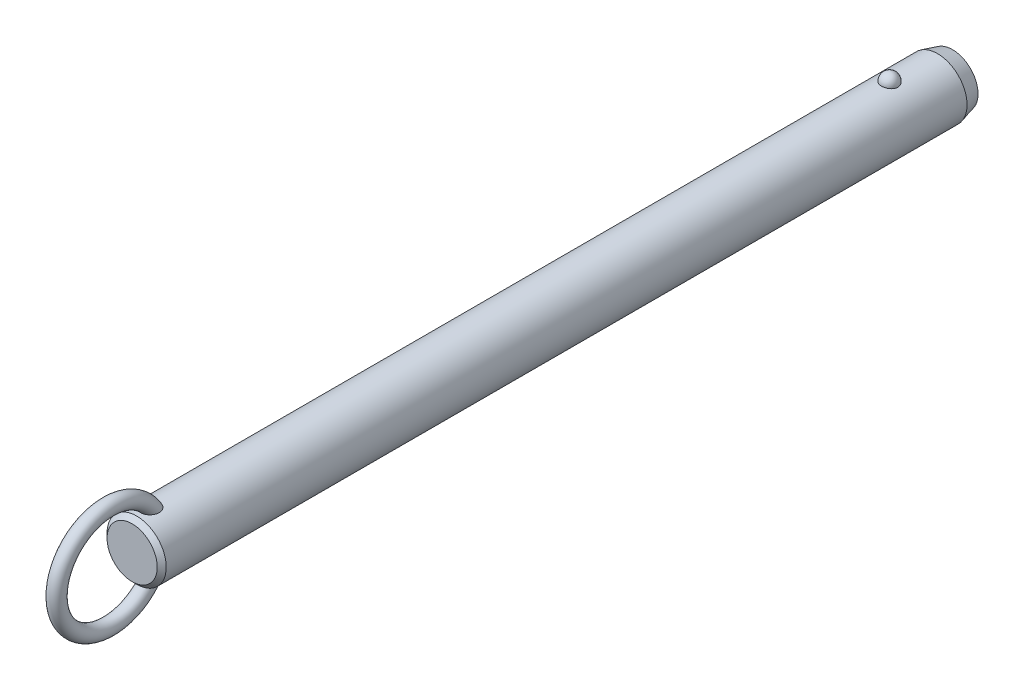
ISO-10303-21;
HEADER;
FILE_DESCRIPTION(('STEP AP214'),'2;1');
FILE_NAME('part.step','',(''),(''),'','','');
FILE_SCHEMA(('AUTOMOTIVE_DESIGN { 1 0 10303 214 1 1 1 1 }'));
ENDSEC;
DATA;
#1=APPLICATION_CONTEXT('core data for automotive mechanical design processes');
#2=APPLICATION_PROTOCOL_DEFINITION('international standard','automotive_design',2000,#1);
#3=PRODUCT_CONTEXT('',#1,'mechanical');
#4=PRODUCT('Part','Part','',(#3));
#5=PRODUCT_RELATED_PRODUCT_CATEGORY('part','',(#4));
#6=PRODUCT_DEFINITION_FORMATION('','',#4);
#7=PRODUCT_DEFINITION_CONTEXT('part definition',#1,'design');
#8=PRODUCT_DEFINITION('design','',#6,#7);
#9=PRODUCT_DEFINITION_SHAPE('','',#8);
#10=(LENGTH_UNIT() NAMED_UNIT(*) SI_UNIT(.MILLI.,.METRE.));
#11=(NAMED_UNIT(*) PLANE_ANGLE_UNIT() SI_UNIT($,.RADIAN.));
#12=(NAMED_UNIT(*) SI_UNIT($,.STERADIAN.) SOLID_ANGLE_UNIT());
#13=UNCERTAINTY_MEASURE_WITH_UNIT(LENGTH_MEASURE(1.E-05),#10,'distance_accuracy_value','');
#14=(GEOMETRIC_REPRESENTATION_CONTEXT(3) GLOBAL_UNCERTAINTY_ASSIGNED_CONTEXT((#13)) GLOBAL_UNIT_ASSIGNED_CONTEXT((#10,
#11,#12)) REPRESENTATION_CONTEXT('',''));
#15=CARTESIAN_POINT('',(0.,0.,0.));
#16=DIRECTION('',(0.,0.,1.));
#17=DIRECTION('',(1.,0.,0.));
#18=AXIS2_PLACEMENT_3D('',#15,#16,#17);
#19=CARTESIAN_POINT('',(0.,0.,190.5));
#20=DIRECTION('',(0.,0.,-1.));
#21=DIRECTION('',(-1.,0.,0.));
#22=AXIS2_PLACEMENT_3D('',#19,#20,#21);
#23=CYLINDRICAL_SURFACE('',#22,7.9);
#24=CARTESIAN_POINT('',(2.1785689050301,7.59367088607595,-2.20000000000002));
#25=CARTESIAN_POINT('',(2.17856679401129,7.59367269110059,-2.07701843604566));
#26=CARTESIAN_POINT('',(2.16853481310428,7.59657145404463,-1.95401006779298));
#27=CARTESIAN_POINT('',(2.12864689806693,7.607843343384,-1.71147811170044));
#28=CARTESIAN_POINT('',(2.09878338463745,7.61621856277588,-1.5919558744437));
#29=CARTESIAN_POINT('',(2.0199931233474,7.63749180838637,-1.35985638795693));
#30=CARTESIAN_POINT('',(1.97107475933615,7.6503878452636,-1.24727610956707));
#31=CARTESIAN_POINT('',(1.85539377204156,7.67926115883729,-1.03213234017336));
#32=CARTESIAN_POINT('',(1.78863158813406,7.69523835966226,-0.929568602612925));
#33=CARTESIAN_POINT('',(1.63856494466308,7.7285848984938,-0.73678633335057));
#34=CARTESIAN_POINT('',(1.55518140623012,7.7459606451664,-0.646630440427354));
#35=CARTESIAN_POINT('',(1.37422937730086,7.78009978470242,-0.481747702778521));
#36=CARTESIAN_POINT('',(1.27666086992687,7.79686317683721,-0.407020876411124));
#37=CARTESIAN_POINT('',(1.07024728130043,7.82786153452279,-0.275278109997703));
#38=CARTESIAN_POINT('',(0.961434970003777,7.84210353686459,-0.218212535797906));
#39=CARTESIAN_POINT('',(0.735351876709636,7.86652194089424,-0.123146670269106));
#40=CARTESIAN_POINT('',(0.618082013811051,7.87669878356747,-0.0851443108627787));
#41=CARTESIAN_POINT('',(0.380637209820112,7.89170521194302,-0.0298158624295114));
#42=CARTESIAN_POINT('',(0.260550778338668,7.89662650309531,-0.0121347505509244));
#43=CARTESIAN_POINT('',(0.0190117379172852,7.90090003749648,0.00324379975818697));
#44=CARTESIAN_POINT('',(-0.102440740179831,7.90025280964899,0.000943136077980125));
#45=CARTESIAN_POINT('',(-0.341452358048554,7.89351056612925,-0.0233955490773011));
#46=CARTESIAN_POINT('',(-0.459042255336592,7.88749257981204,-0.0451545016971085));
#47=CARTESIAN_POINT('',(-0.688796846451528,7.87075812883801,-0.107408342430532));
#48=CARTESIAN_POINT('',(-0.800961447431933,7.86004158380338,-0.14790355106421));
#49=CARTESIAN_POINT('',(-1.01743634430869,7.83497131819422,-0.246799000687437));
#50=CARTESIAN_POINT('',(-1.12169791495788,7.82059709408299,-0.305300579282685));
#51=CARTESIAN_POINT('',(-1.31891765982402,7.78976470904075,-0.43854939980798));
#52=CARTESIAN_POINT('',(-1.41187469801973,7.77330633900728,-0.513298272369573));
#53=CARTESIAN_POINT('',(-1.58577142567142,7.73972434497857,-0.678622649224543));
#54=CARTESIAN_POINT('',(-1.66645140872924,7.72259402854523,-0.769470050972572));
#55=CARTESIAN_POINT('',(-1.81161503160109,7.68983776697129,-0.963538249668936));
#56=CARTESIAN_POINT('',(-1.87609753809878,7.6742119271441,-1.0667599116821));
#57=CARTESIAN_POINT('',(-1.98790138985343,7.6460202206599,-1.28401170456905));
#58=CARTESIAN_POINT('',(-2.03501994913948,7.63349104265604,-1.39815107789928));
#59=CARTESIAN_POINT('',(-2.10986724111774,7.6131449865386,-1.6330178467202));
#60=CARTESIAN_POINT('',(-2.1375965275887,7.60532797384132,-1.75374505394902));
#61=CARTESIAN_POINT('',(-2.17289256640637,7.5953195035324,-1.99782562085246));
#62=CARTESIAN_POINT('',(-2.18054294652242,7.59310471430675,-2.12116592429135));
#63=CARTESIAN_POINT('',(-2.17572919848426,7.59448538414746,-2.36741799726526));
#64=CARTESIAN_POINT('',(-2.1632656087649,7.59808068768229,-2.49032977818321));
#65=CARTESIAN_POINT('',(-2.11865035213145,7.61064035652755,-2.73161015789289));
#66=CARTESIAN_POINT('',(-2.08659579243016,7.61957823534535,-2.84999812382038));
#67=CARTESIAN_POINT('',(-2.00367799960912,7.64179982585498,-3.07955956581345));
#68=CARTESIAN_POINT('',(-1.9528140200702,7.65508371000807,-3.19073275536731));
#69=CARTESIAN_POINT('',(-1.83321113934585,7.68460381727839,-3.40337899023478));
#70=CARTESIAN_POINT('',(-1.76437735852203,7.70085556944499,-3.5047965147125));
#71=CARTESIAN_POINT('',(-1.61069526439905,7.73445734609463,-3.69446912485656));
#72=CARTESIAN_POINT('',(-1.52584634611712,7.75180741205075,-3.78272371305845));
#73=CARTESIAN_POINT('',(-1.34198059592,7.78574608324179,-3.94393987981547));
#74=CARTESIAN_POINT('',(-1.24291308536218,7.80233167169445,-4.01684434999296));
#75=CARTESIAN_POINT('',(-1.03352039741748,7.83281625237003,-4.14489386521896));
#76=CARTESIAN_POINT('',(-0.92319600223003,7.84671543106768,-4.20004014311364));
#77=CARTESIAN_POINT('',(-0.695822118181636,7.87011575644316,-4.29042017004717));
#78=CARTESIAN_POINT('',(-0.578872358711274,7.87966903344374,-4.32589112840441));
#79=CARTESIAN_POINT('',(-0.340410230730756,7.8935652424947,-4.37692226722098));
#80=CARTESIAN_POINT('',(-0.218898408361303,7.89790879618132,-4.39248482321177));
#81=CARTESIAN_POINT('',(0.0228107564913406,7.90087453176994,-4.40314405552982));
#82=CARTESIAN_POINT('',(0.142990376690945,7.89960185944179,-4.39861683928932));
#83=CARTESIAN_POINT('',(0.380829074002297,7.89171262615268,-4.37008293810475));
#84=CARTESIAN_POINT('',(0.498488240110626,7.8850962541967,-4.34607694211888));
#85=CARTESIAN_POINT('',(0.727535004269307,7.86726442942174,-4.27939317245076));
#86=CARTESIAN_POINT('',(0.838944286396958,7.85606616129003,-4.23678512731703));
#87=CARTESIAN_POINT('',(1.05295421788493,7.83025654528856,-4.13408348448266));
#88=CARTESIAN_POINT('',(1.15555431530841,7.81564498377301,-4.07398879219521));
#89=CARTESIAN_POINT('',(1.35076763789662,7.7843022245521,-3.93687432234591));
#90=CARTESIAN_POINT('',(1.4432046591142,7.76754209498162,-3.85961036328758));
#91=CARTESIAN_POINT('',(1.6139111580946,7.73387857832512,-3.69076949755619));
#92=CARTESIAN_POINT('',(1.6921781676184,7.71697516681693,-3.59919010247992));
#93=CARTESIAN_POINT('',(1.83380875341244,7.6845643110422,-3.40247278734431));
#94=CARTESIAN_POINT('',(1.89689280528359,7.66908588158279,-3.29712873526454));
#95=CARTESIAN_POINT('',(2.0047823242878,7.64159441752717,-3.07707931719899));
#96=CARTESIAN_POINT('',(2.0495945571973,7.62958010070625,-2.96237743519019));
#97=CARTESIAN_POINT('',(2.11580183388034,7.61146617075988,-2.74040519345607));
#98=CARTESIAN_POINT('',(2.13929812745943,7.60484503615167,-2.63379846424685));
#99=CARTESIAN_POINT('',(2.17068242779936,7.59594664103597,-2.4181348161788));
#100=CARTESIAN_POINT('',(2.17857077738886,7.59366928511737,-2.30907795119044));
#101=CARTESIAN_POINT('',(2.1785689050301,7.59367088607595,-2.20000000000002));
#102=B_SPLINE_CURVE_WITH_KNOTS('',3,(#24,#25,#26,#27,#28,#29,#30,#31,#32,#33,#34,#35,#36,#37,
#38,#39,#40,#41,#42,#43,#44,#45,#46,#47,#48,#49,#50,#51,#52,#53,#54,#55,#56,#57,#58,#59,#60,#61,
#62,#63,#64,#65,#66,#67,#68,#69,#70,#71,#72,#73,#74,#75,#76,#77,#78,#79,#80,#81,#82,#83,#84,#85,
#86,#87,#88,#89,#90,#91,#92,#93,#94,#95,#96,#97,#98,#99,#100,#101),.UNSPECIFIED.,.T.,.F.,(4,2,2,
2,2,2,2,2,2,2,2,2,2,2,2,2,2,2,2,2,2,2,2,2,2,2,2,2,2,2,2,2,2,2,2,2,2,2,4),(0.,0.368552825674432,
0.737246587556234,1.10577831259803,1.4743009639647,1.8446206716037,2.21494081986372,
2.5842105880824,2.95344028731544,3.31611630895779,3.67875788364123,4.03628044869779,
4.39380913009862,4.75338791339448,5.11300280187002,5.47939989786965,5.8458226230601,
6.21639834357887,6.58696347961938,6.95598276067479,7.32499216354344,7.69218715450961,
8.0593967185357,8.42858578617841,8.79778880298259,9.16834203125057,9.5388695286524,
9.90482699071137,10.2707407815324,10.6298333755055,10.9889132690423,11.3466585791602,
11.7044262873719,12.0676511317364,12.4309391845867,12.8004764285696,13.1698767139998,
13.4967701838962,13.8236564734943),.UNSPECIFIED.);
#103=CARTESIAN_POINT('',(2.1785689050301,7.59367088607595,-2.20000000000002));
#104=VERTEX_POINT('',#103);
#105=EDGE_CURVE('E41',#104,#104,#102,.T.);
#106=ORIENTED_EDGE('',*,*,#105,.T.);
#107=EDGE_LOOP('',(#106));
#108=FACE_BOUND('',#107,.T.);
#109=CARTESIAN_POINT('',(0.,0.,198.82));
#110=DIRECTION('',(0.,0.,1.));
#111=DIRECTION('',(1.,0.,0.));
#112=AXIS2_PLACEMENT_3D('',#109,#110,#111);
#113=CIRCLE('',#112,7.9);
#114=CARTESIAN_POINT('',(7.9,0.,198.82));
#115=VERTEX_POINT('',#114);
#116=EDGE_CURVE('E10',#115,#115,#113,.F.);
#117=ORIENTED_EDGE('',*,*,#116,.T.);
#118=EDGE_LOOP('',(#117));
#119=FACE_BOUND('',#118,.T.);
#120=CARTESIAN_POINT('',(-0.630969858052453,-7.87476203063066,192.712432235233));
#121=CARTESIAN_POINT('',(-0.734180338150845,-7.86648998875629,192.747285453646));
#122=CARTESIAN_POINT('',(-0.83447695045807,-7.85639291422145,192.790816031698));
#123=CARTESIAN_POINT('',(-1.0262035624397,-7.83366343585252,192.894094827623));
#124=CARTESIAN_POINT('',(-1.1176141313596,-7.82102565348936,192.953877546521));
#125=CARTESIAN_POINT('',(-1.28877277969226,-7.79464922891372,193.087839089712));
#126=CARTESIAN_POINT('',(-1.36854014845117,-7.78091246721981,193.161993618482));
#127=CARTESIAN_POINT('',(-1.51461521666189,-7.75380398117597,193.322494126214));
#128=CARTESIAN_POINT('',(-1.58092966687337,-7.74043207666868,193.408833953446));
#129=CARTESIAN_POINT('',(-1.70019064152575,-7.7151252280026,193.592978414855));
#130=CARTESIAN_POINT('',(-1.75284037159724,-7.70322473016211,193.690979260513));
#131=CARTESIAN_POINT('',(-1.84263464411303,-7.68224112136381,193.894102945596));
#132=CARTESIAN_POINT('',(-1.87977299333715,-7.6731591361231,193.999228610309));
#133=CARTESIAN_POINT('',(-1.94152728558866,-7.65777930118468,194.223284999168));
#134=CARTESIAN_POINT('',(-1.96475471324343,-7.65179654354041,194.342616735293));
#135=CARTESIAN_POINT('',(-1.99449499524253,-7.64409642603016,194.58342986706));
#136=CARTESIAN_POINT('',(-2.0010005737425,-7.64238092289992,194.704912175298));
#137=CARTESIAN_POINT('',(-1.99856014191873,-7.64302120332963,194.968340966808));
#138=CARTESIAN_POINT('',(-1.98680021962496,-7.64611845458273,195.11025654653));
#139=CARTESIAN_POINT('',(-1.94457772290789,-7.65696186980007,195.391118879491));
#140=CARTESIAN_POINT('',(-1.91409393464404,-7.66471330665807,195.530062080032));
#141=CARTESIAN_POINT('',(-1.82768670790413,-7.68582947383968,195.831939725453));
#142=CARTESIAN_POINT('',(-1.76772963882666,-7.70003779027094,195.993686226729));
#143=CARTESIAN_POINT('',(-1.65998501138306,-7.72371550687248,196.227695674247));
#144=CARTESIAN_POINT('',(-1.62107967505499,-7.73200670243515,196.304297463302));
#145=CARTESIAN_POINT('',(-1.53727726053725,-7.7491037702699,196.454079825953));
#146=CARTESIAN_POINT('',(-1.49238215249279,-7.75790947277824,196.527261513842));
#147=CARTESIAN_POINT('',(-1.37397050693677,-7.77993338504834,196.70288382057));
#148=CARTESIAN_POINT('',(-1.29690364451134,-7.79328473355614,196.802955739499));
#149=CARTESIAN_POINT('',(-1.12885487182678,-7.81939266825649,196.990714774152));
#150=CARTESIAN_POINT('',(-1.03789926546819,-7.83215032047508,197.078424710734));
#151=CARTESIAN_POINT('',(-0.869532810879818,-7.85231710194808,197.213414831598));
#152=CARTESIAN_POINT('',(-0.795716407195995,-7.86021093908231,197.265076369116));
#153=CARTESIAN_POINT('',(-0.640813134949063,-7.87434920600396,197.356381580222));
#154=CARTESIAN_POINT('',(-0.559737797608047,-7.88059619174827,197.39604389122));
#155=CARTESIAN_POINT('',(-0.406456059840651,-7.88984116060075,197.454300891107));
#156=CARTESIAN_POINT('',(-0.335227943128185,-7.89321892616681,197.475384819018));
#157=CARTESIAN_POINT('',(-0.190193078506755,-7.89804235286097,197.50541418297));
#158=CARTESIAN_POINT('',(-0.116388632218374,-7.89948969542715,197.514370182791));
#159=CARTESIAN_POINT('',(0.0318414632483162,-7.90028409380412,197.519291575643));
#160=CARTESIAN_POINT('',(0.106268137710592,-7.89962640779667,197.515227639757));
#161=CARTESIAN_POINT('',(0.253290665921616,-7.8962818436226,197.494461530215));
#162=CARTESIAN_POINT('',(0.325885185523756,-7.8935935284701,197.477750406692));
#163=CARTESIAN_POINT('',(0.481441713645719,-7.88577340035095,197.428738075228));
#164=CARTESIAN_POINT('',(0.563611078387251,-7.88026321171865,197.394005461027));
#165=CARTESIAN_POINT('',(0.721129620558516,-7.86741729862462,197.311796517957));
#166=CARTESIAN_POINT('',(0.79646633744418,-7.86007832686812,197.264297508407));
#167=CARTESIAN_POINT('',(0.971456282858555,-7.84073285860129,197.136513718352));
#168=CARTESIAN_POINT('',(1.06719686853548,-7.82809461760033,197.051004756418));
#169=CARTESIAN_POINT('',(1.24418921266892,-7.80192439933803,196.866232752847));
#170=CARTESIAN_POINT('',(1.32540832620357,-7.78839049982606,196.766939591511));
#171=CARTESIAN_POINT('',(1.45199971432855,-7.76559693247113,196.589576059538));
#172=CARTESIAN_POINT('',(1.50085649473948,-7.75626094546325,196.513954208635));
#173=CARTESIAN_POINT('',(1.59197749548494,-7.73807279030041,196.358742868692));
#174=CARTESIAN_POINT('',(1.63423919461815,-7.72922080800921,196.279151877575));
#175=CARTESIAN_POINT('',(1.71222612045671,-7.71231959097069,196.116664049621));
#176=CARTESIAN_POINT('',(1.74794516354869,-7.70427111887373,196.033764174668));
#177=CARTESIAN_POINT('',(1.81270113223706,-7.68929240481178,195.865296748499));
#178=CARTESIAN_POINT('',(1.84173789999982,-7.68236218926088,195.779729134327));
#179=CARTESIAN_POINT('',(1.89322698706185,-7.6698375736,195.60528702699));
#180=CARTESIAN_POINT('',(1.91558744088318,-7.66426199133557,195.516383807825));
#181=CARTESIAN_POINT('',(1.95281367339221,-7.65485915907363,195.336969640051));
#182=CARTESIAN_POINT('',(1.96767946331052,-7.65103190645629,195.246458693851));
#183=CARTESIAN_POINT('',(2.0002145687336,-7.64262981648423,194.973732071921));
#184=CARTESIAN_POINT('',(2.00600691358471,-7.6410871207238,194.789709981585));
#185=CARTESIAN_POINT('',(1.98445334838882,-7.64669564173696,194.476501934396));
#186=CARTESIAN_POINT('',(1.96607186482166,-7.65149688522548,194.346618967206));
#187=CARTESIAN_POINT('',(1.90884967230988,-7.66597624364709,194.091632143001));
#188=CARTESIAN_POINT('',(1.87002101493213,-7.67565148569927,193.966525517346));
#189=CARTESIAN_POINT('',(1.77063986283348,-7.69918471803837,193.72454013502));
#190=CARTESIAN_POINT('',(1.70993724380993,-7.71307150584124,193.607725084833));
#191=CARTESIAN_POINT('',(1.56733070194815,-7.74330306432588,193.388144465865));
#192=CARTESIAN_POINT('',(1.48543692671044,-7.75964665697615,193.285372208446));
#193=CARTESIAN_POINT('',(1.31346177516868,-7.79047523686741,193.109380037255));
#194=CARTESIAN_POINT('',(1.22547278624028,-7.80495298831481,193.034106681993));
#195=CARTESIAN_POINT('',(1.03724352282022,-7.83218597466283,192.900486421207));
#196=CARTESIAN_POINT('',(0.93700840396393,-7.84494192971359,192.842132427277));
#197=CARTESIAN_POINT('',(0.73359933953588,-7.86649045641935,192.747027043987));
#198=CARTESIAN_POINT('',(0.630941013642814,-7.87547134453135,192.709210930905));
#199=CARTESIAN_POINT('',(0.420465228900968,-7.88950708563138,192.651116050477));
#200=CARTESIAN_POINT('',(0.312645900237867,-7.89456050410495,192.63084369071));
#201=CARTESIAN_POINT('',(0.0960869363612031,-7.9001518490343,192.608455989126));
#202=CARTESIAN_POINT('',(-0.0126341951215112,-7.90073226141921,192.606169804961));
#203=CARTESIAN_POINT('',(-0.228766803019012,-7.89742350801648,192.619367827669));
#204=CARTESIAN_POINT('',(-0.336180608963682,-7.89354403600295,192.634813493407));
#205=CARTESIAN_POINT('',(-0.473410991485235,-7.88586871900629,192.666217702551));
#206=CARTESIAN_POINT('',(-0.50525779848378,-7.88388984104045,192.674354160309));
#207=CARTESIAN_POINT('',(-0.56848128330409,-7.87958326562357,192.692208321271));
#208=CARTESIAN_POINT('',(-0.59985795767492,-7.87725556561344,192.701926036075));
#209=CARTESIAN_POINT('',(-0.630969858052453,-7.87476203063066,192.712432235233));
#210=B_SPLINE_CURVE_WITH_KNOTS('',3,(#120,#121,#122,#123,#124,#125,#126,#127,#128,#129,#130,
#131,#132,#133,#134,#135,#136,#137,#138,#139,#140,#141,#142,#143,#144,#145,#146,#147,#148,#149,
#150,#151,#152,#153,#154,#155,#156,#157,#158,#159,#160,#161,#162,#163,#164,#165,#166,#167,#168,
#169,#170,#171,#172,#173,#174,#175,#176,#177,#178,#179,#180,#181,#182,#183,#184,#185,#186,#187,
#188,#189,#190,#191,#192,#193,#194,#195,#196,#197,#198,#199,#200,#201,#202,#203,#204,#205,#206,
#207,#208,#209),.UNSPECIFIED.,.T.,.F.,(4,2,2,2,2,2,2,2,2,2,2,2,2,2,2,2,2,2,2,2,2,2,2,2,2,2,2,2,
2,2,2,2,2,2,2,2,2,2,2,2,2,2,2,2,4),(0.,0.327622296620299,0.655945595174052,0.983718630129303,
1.3113267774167,1.64554655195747,1.97989964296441,2.34365728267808,2.70757317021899,
3.13333684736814,3.5595838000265,4.07655306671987,4.33527897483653,4.59391999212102,
4.97382437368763,5.353017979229,5.62348245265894,5.89352465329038,6.11565959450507,
6.33760092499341,6.56004255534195,6.78264174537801,7.04930844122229,7.31645206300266,
7.70130871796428,8.08701995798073,8.35824509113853,8.6295736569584,8.90115735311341,
9.1727474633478,9.44791855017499,9.72308922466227,10.2715298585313,10.6638393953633,
11.0559179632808,11.4507403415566,11.8453740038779,12.1936425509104,12.5417649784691,
12.8695063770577,13.1973674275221,13.5221104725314,13.8461490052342,13.9449071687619,
14.0436660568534),.UNSPECIFIED.);
#211=CARTESIAN_POINT('',(-0.630969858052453,-7.87476203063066,192.712432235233));
#212=VERTEX_POINT('',#211);
#213=EDGE_CURVE('E59',#212,#212,#210,.T.);
#214=ORIENTED_EDGE('',*,*,#213,.T.);
#215=EDGE_LOOP('',(#214));
#216=FACE_BOUND('',#215,.T.);
#217=CARTESIAN_POINT('',(-0.630969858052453,7.87476203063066,192.712432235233));
#218=CARTESIAN_POINT('',(-0.528918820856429,7.88293636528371,192.677979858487));
#219=CARTESIAN_POINT('',(-0.423745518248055,7.88934810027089,192.651915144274));
#220=CARTESIAN_POINT('',(-0.210236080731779,7.8979273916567,192.617282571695));
#221=CARTESIAN_POINT('',(-0.10189380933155,7.90008607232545,192.608751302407));
#222=CARTESIAN_POINT('',(0.114660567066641,7.89990877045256,192.609457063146));
#223=CARTESIAN_POINT('',(0.222872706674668,7.89757640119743,192.61867980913));
#224=CARTESIAN_POINT('',(0.436107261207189,7.88867538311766,192.654652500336));
#225=CARTESIAN_POINT('',(0.541131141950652,7.8821087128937,192.68139425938));
#226=CARTESIAN_POINT('',(0.745085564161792,7.86545130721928,192.751756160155));
#227=CARTESIAN_POINT('',(0.844015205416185,7.85536005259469,192.795378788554));
#228=CARTESIAN_POINT('',(1.03299167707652,7.83275153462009,192.898379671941));
#229=CARTESIAN_POINT('',(1.12303841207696,7.8202342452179,192.957758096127));
#230=CARTESIAN_POINT('',(1.29214734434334,7.79408219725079,193.090864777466));
#231=CARTESIAN_POINT('',(1.37116907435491,7.78044359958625,193.164643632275));
#232=CARTESIAN_POINT('',(1.51597677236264,7.75353170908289,193.324235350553));
#233=CARTESIAN_POINT('',(1.58176261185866,7.74025841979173,193.410048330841));
#234=CARTESIAN_POINT('',(1.70057386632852,7.71504069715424,193.593644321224));
#235=CARTESIAN_POINT('',(1.75320073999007,7.7031425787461,193.691690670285));
#236=CARTESIAN_POINT('',(1.8429376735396,7.68216822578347,193.894893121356));
#237=CARTESIAN_POINT('',(1.88004278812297,7.67309289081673,194.000051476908));
#238=CARTESIAN_POINT('',(1.9417232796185,7.6577294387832,194.224167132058));
#239=CARTESIAN_POINT('',(1.96491037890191,7.65175648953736,194.343524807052));
#240=CARTESIAN_POINT('',(1.9945689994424,7.64407702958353,194.584384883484));
#241=CARTESIAN_POINT('',(2.00103304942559,7.64237242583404,194.70588821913));
#242=CARTESIAN_POINT('',(1.99850166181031,7.64303650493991,194.969368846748));
#243=CARTESIAN_POINT('',(1.98669038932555,7.64614714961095,195.111314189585));
#244=CARTESIAN_POINT('',(1.94436120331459,7.6570170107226,195.392228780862));
#245=CARTESIAN_POINT('',(1.91382203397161,7.66478150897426,195.531194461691));
#246=CARTESIAN_POINT('',(1.82728754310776,7.68592483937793,195.833111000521));
#247=CARTESIAN_POINT('',(1.76725778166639,7.7001468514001,195.994872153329));
#248=CARTESIAN_POINT('',(1.65939700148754,7.72384204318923,196.228891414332));
#249=CARTESIAN_POINT('',(1.62045187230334,7.73213852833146,196.305494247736));
#250=CARTESIAN_POINT('',(1.53656684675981,7.74924489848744,196.455273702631));
#251=CARTESIAN_POINT('',(1.49162892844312,7.75805461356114,196.528451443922));
#252=CARTESIAN_POINT('',(1.37317698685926,7.78007342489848,196.703952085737));
#253=CARTESIAN_POINT('',(1.29612360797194,7.79341423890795,196.803911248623));
#254=CARTESIAN_POINT('',(1.12812043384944,7.81949839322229,196.99145083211));
#255=CARTESIAN_POINT('',(1.03719688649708,7.83224280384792,197.079054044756));
#256=CARTESIAN_POINT('',(0.868871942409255,7.85239026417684,197.21389715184));
#257=CARTESIAN_POINT('',(0.795056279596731,7.86027769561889,197.265511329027));
#258=CARTESIAN_POINT('',(0.640160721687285,7.87440222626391,197.356720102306));
#259=CARTESIAN_POINT('',(0.559092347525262,7.88064188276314,197.396333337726));
#260=CARTESIAN_POINT('',(0.405820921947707,7.8898738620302,197.454505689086));
#261=CARTESIAN_POINT('',(0.334594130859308,7.89324577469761,197.475552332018));
#262=CARTESIAN_POINT('',(0.189568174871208,7.89805733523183,197.505507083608));
#263=CARTESIAN_POINT('',(0.115771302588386,7.89949866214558,197.514425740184));
#264=CARTESIAN_POINT('',(-0.0324359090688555,7.90028156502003,197.51927589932));
#265=CARTESIAN_POINT('',(-0.106847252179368,7.89961843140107,197.515178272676));
#266=CARTESIAN_POINT('',(-0.253834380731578,7.8962642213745,197.494351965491));
#267=CARTESIAN_POINT('',(-0.326408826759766,7.89357170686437,197.477614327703));
#268=CARTESIAN_POINT('',(-0.481962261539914,7.88574179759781,197.428539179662));
#269=CARTESIAN_POINT('',(-0.564145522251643,7.88022507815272,197.393763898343));
#270=CARTESIAN_POINT('',(-0.721685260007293,7.86736646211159,197.311468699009));
#271=CARTESIAN_POINT('',(-0.797029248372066,7.8600213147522,197.263926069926));
#272=CARTESIAN_POINT('',(-0.972044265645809,7.84066026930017,197.136026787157));
#273=CARTESIAN_POINT('',(-1.06779803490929,7.828012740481,197.050443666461));
#274=CARTESIAN_POINT('',(-1.24480531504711,7.80182621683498,196.865522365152));
#275=CARTESIAN_POINT('',(-1.32602618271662,7.78828530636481,196.766154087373));
#276=CARTESIAN_POINT('',(-1.45259834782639,7.76548487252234,196.588680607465));
#277=CARTESIAN_POINT('',(-1.50143856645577,7.75614818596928,196.513025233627));
#278=CARTESIAN_POINT('',(-1.59252410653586,7.73796020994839,196.357748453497));
#279=CARTESIAN_POINT('',(-1.63476690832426,7.72910910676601,196.278125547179));
#280=CARTESIAN_POINT('',(-1.71271318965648,7.71221133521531,196.115575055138));
#281=CARTESIAN_POINT('',(-1.74841047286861,7.70416543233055,196.032644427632));
#282=CARTESIAN_POINT('',(-1.81311929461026,7.6891937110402,195.864116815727));
#283=CARTESIAN_POINT('',(-1.84213067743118,7.68226791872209,195.778519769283));
#284=CARTESIAN_POINT('',(-1.89356259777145,7.66975461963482,195.604025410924));
#285=CARTESIAN_POINT('',(-1.91589165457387,7.66418586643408,195.515099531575));
#286=CARTESIAN_POINT('',(-1.9530507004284,7.65479859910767,195.335642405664));
#287=CARTESIAN_POINT('',(-1.96788069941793,7.65098008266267,195.245111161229));
#288=CARTESIAN_POINT('',(-2.00030078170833,7.64260704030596,194.972327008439));
#289=CARTESIAN_POINT('',(-2.00600576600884,7.64108760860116,194.788271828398));
#290=CARTESIAN_POINT('',(-1.9842848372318,7.64673945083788,194.475080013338));
#291=CARTESIAN_POINT('',(-1.96583698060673,7.65155751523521,194.345240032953));
#292=CARTESIAN_POINT('',(-1.90848948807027,7.66606613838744,194.090361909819));
#293=CARTESIAN_POINT('',(-1.86960376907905,7.67575338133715,193.965320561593));
#294=CARTESIAN_POINT('',(-1.77013421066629,7.6993013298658,193.723500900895));
#295=CARTESIAN_POINT('',(-1.70940488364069,7.71318991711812,193.606784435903));
#296=CARTESIAN_POINT('',(-1.56672953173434,7.74342495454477,193.387340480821));
#297=CARTESIAN_POINT('',(-1.48478316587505,7.75977144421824,193.28461321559));
#298=CARTESIAN_POINT('',(-1.31266325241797,7.79061163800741,193.108643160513));
#299=CARTESIAN_POINT('',(-1.22456383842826,7.80509908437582,193.033358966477));
#300=CARTESIAN_POINT('',(-1.03622400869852,7.83231881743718,192.899865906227));
#301=CARTESIAN_POINT('',(-0.936015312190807,7.84505551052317,192.841613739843));
#302=CARTESIAN_POINT('',(-0.798824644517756,7.85957802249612,192.777540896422));
#303=CARTESIAN_POINT('',(-0.765787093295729,7.86286821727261,192.763224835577));
#304=CARTESIAN_POINT('',(-0.698939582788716,7.86909211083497,192.736436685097));
#305=CARTESIAN_POINT('',(-0.66512963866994,7.8720258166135,192.723964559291));
#306=CARTESIAN_POINT('',(-0.630969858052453,7.87476203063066,192.712432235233));
#307=B_SPLINE_CURVE_WITH_KNOTS('',3,(#217,#218,#219,#220,#221,#222,#223,#224,#225,#226,#227,
#228,#229,#230,#231,#232,#233,#234,#235,#236,#237,#238,#239,#240,#241,#242,#243,#244,#245,#246,
#247,#248,#249,#250,#251,#252,#253,#254,#255,#256,#257,#258,#259,#260,#261,#262,#263,#264,#265,
#266,#267,#268,#269,#270,#271,#272,#273,#274,#275,#276,#277,#278,#279,#280,#281,#282,#283,#284,
#285,#286,#287,#288,#289,#290,#291,#292,#293,#294,#295,#296,#297,#298,#299,#300,#301,#302,#303,
#304,#305,#306),.UNSPECIFIED.,.T.,.F.,(4,2,2,2,2,2,2,2,2,2,2,2,2,2,2,2,2,2,2,2,2,2,2,2,2,2,2,2,
2,2,2,2,2,2,2,2,2,2,2,2,2,2,2,2,4),(0.,0.323920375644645,0.648516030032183,0.972850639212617,
1.29703380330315,1.62126473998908,1.94549915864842,2.27089401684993,2.5962920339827,
2.93059633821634,3.26500707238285,3.6288164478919,3.99278833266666,4.4186542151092,
4.84500434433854,5.36209210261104,5.62087589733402,5.87957448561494,6.25918598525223,
6.63808782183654,6.90846748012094,7.17842501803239,7.40052350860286,7.6224287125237,
7.84483086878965,8.06739077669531,8.33414615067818,8.60137921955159,8.98641454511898,
9.37230415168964,9.64358673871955,9.91497268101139,10.1866142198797,10.4582620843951,
10.7334745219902,11.008686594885,11.5572126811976,11.9494246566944,12.3413699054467,
12.7359755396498,13.1305875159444,13.4791770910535,13.82687259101,13.9353013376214,
14.0437279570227),.UNSPECIFIED.);
#308=CARTESIAN_POINT('',(-0.630969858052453,7.87476203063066,192.712432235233));
#309=VERTEX_POINT('',#308);
#310=EDGE_CURVE('E67',#309,#309,#307,.T.);
#311=ORIENTED_EDGE('',*,*,#310,.T.);
#312=EDGE_LOOP('',(#311));
#313=FACE_BOUND('',#312,.T.);
#314=CARTESIAN_POINT('',(0.,0.,-15.));
#315=DIRECTION('',(0.,0.,-1.));
#316=DIRECTION('',(-1.,0.,0.));
#317=AXIS2_PLACEMENT_3D('',#314,#315,#316);
#318=CIRCLE('',#317,7.9);
#319=CARTESIAN_POINT('',(-7.9,0.,-15.));
#320=VERTEX_POINT('',#319);
#321=EDGE_CURVE('E56',#320,#320,#318,.F.);
#322=ORIENTED_EDGE('',*,*,#321,.T.);
#323=EDGE_LOOP('',(#322));
#324=FACE_BOUND('',#323,.T.);
#325=ADVANCED_FACE('F37',(#108,#119,#216,#313,#324),#23,.T.);
#326=CARTESIAN_POINT('',(0.,0.,-19.));
#327=DIRECTION('',(0.,0.,-1.));
#328=DIRECTION('',(-1.,0.,0.));
#329=AXIS2_PLACEMENT_3D('',#326,#327,#328);
#330=PLANE('',#329);
#331=CARTESIAN_POINT('',(0.,0.,-19.));
#332=DIRECTION('',(0.,0.,-1.));
#333=DIRECTION('',(-1.,0.,0.));
#334=AXIS2_PLACEMENT_3D('',#331,#332,#333);
#335=CIRCLE('',#334,6.82820323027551);
#336=CARTESIAN_POINT('',(-6.82820323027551,0.,-19.));
#337=VERTEX_POINT('',#336);
#338=EDGE_CURVE('E66',#337,#337,#335,.T.);
#339=ORIENTED_EDGE('',*,*,#338,.T.);
#340=EDGE_LOOP('',(#339));
#341=FACE_BOUND('',#340,.T.);
#342=ADVANCED_FACE('F85',(#341),#330,.T.);
#343=CARTESIAN_POINT('',(0.,0.,-19.));
#344=DIRECTION('',(0.,0.,1.));
#345=DIRECTION('',(1.,0.,0.));
#346=AXIS2_PLACEMENT_3D('',#343,#344,#345);
#347=CONICAL_SURFACE('',#346,6.82820323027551,0.261799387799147);
#348=ORIENTED_EDGE('',*,*,#321,.F.);
#349=EDGE_LOOP('',(#348));
#350=FACE_BOUND('',#349,.T.);
#351=ORIENTED_EDGE('',*,*,#338,.F.);
#352=EDGE_LOOP('',(#351));
#353=FACE_BOUND('',#352,.T.);
#354=ADVANCED_FACE('F83',(#350,#353),#347,.T.);
#355=CARTESIAN_POINT('',(0.,0.,200.02));
#356=DIRECTION('',(0.,0.,1.));
#357=DIRECTION('',(1.,0.,0.));
#358=AXIS2_PLACEMENT_3D('',#355,#356,#357);
#359=PLANE('',#358);
#360=CARTESIAN_POINT('',(0.,0.,200.02));
#361=DIRECTION('',(0.,0.,1.));
#362=DIRECTION('',(1.,0.,0.));
#363=AXIS2_PLACEMENT_3D('',#360,#361,#362);
#364=CIRCLE('',#363,6.70000000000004);
#365=CARTESIAN_POINT('',(6.70000000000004,0.,200.02));
#366=VERTEX_POINT('',#365);
#367=EDGE_CURVE('E50',#366,#366,#364,.T.);
#368=ORIENTED_EDGE('',*,*,#367,.T.);
#369=EDGE_LOOP('',(#368));
#370=FACE_BOUND('',#369,.T.);
#371=ADVANCED_FACE('F77',(#370),#359,.T.);
#372=CARTESIAN_POINT('',(0.,0.,206.35));
#373=DIRECTION('',(1.,0.,0.));
#374=DIRECTION('',(0.,0.,-1.));
#375=AXIS2_PLACEMENT_3D('',#372,#373,#374);
#376=TOROIDAL_SURFACE('',#375,13.85,2.);
#377=ORIENTED_EDGE('',*,*,#310,.F.);
#378=EDGE_LOOP('',(#377));
#379=FACE_BOUND('',#378,.T.);
#380=ORIENTED_EDGE('',*,*,#213,.F.);
#381=EDGE_LOOP('',(#380));
#382=FACE_BOUND('',#381,.T.);
#383=ADVANCED_FACE('F73',(#379,#382),#376,.T.);
#384=CARTESIAN_POINT('',(0.,0.,200.02));
#385=DIRECTION('',(0.,0.,-1.));
#386=DIRECTION('',(-1.,0.,0.));
#387=AXIS2_PLACEMENT_3D('',#384,#385,#386);
#388=CONICAL_SURFACE('',#387,6.70000000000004,0.785398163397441);
#389=ORIENTED_EDGE('',*,*,#116,.F.);
#390=EDGE_LOOP('',(#389));
#391=FACE_BOUND('',#390,.T.);
#392=ORIENTED_EDGE('',*,*,#367,.F.);
#393=EDGE_LOOP('',(#392));
#394=FACE_BOUND('',#393,.T.);
#395=ADVANCED_FACE('F39',(#391,#394),#388,.T.);
#396=CARTESIAN_POINT('',(0.,7.9,-2.20000000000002));
#397=DIRECTION('',(0.,1.,0.));
#398=DIRECTION('',(0.,0.,-1.));
#399=AXIS2_PLACEMENT_3D('',#396,#397,#398);
#400=SPHERICAL_SURFACE('',#399,2.2);
#401=ORIENTED_EDGE('',*,*,#105,.F.);
#402=EDGE_LOOP('',(#401));
#403=FACE_BOUND('',#402,.T.);
#404=ADVANCED_FACE('F79',(#403),#400,.T.);
#405=CLOSED_SHELL('',(#325,#342,#354,#371,#383,#395,#404));
#406=MANIFOLD_SOLID_BREP('B2',#405);
#407=ADVANCED_BREP_SHAPE_REPRESENTATION('',(#18,#406),#14);
#408=SHAPE_DEFINITION_REPRESENTATION(#9,#407);
ENDSEC;
END-ISO-10303-21;
